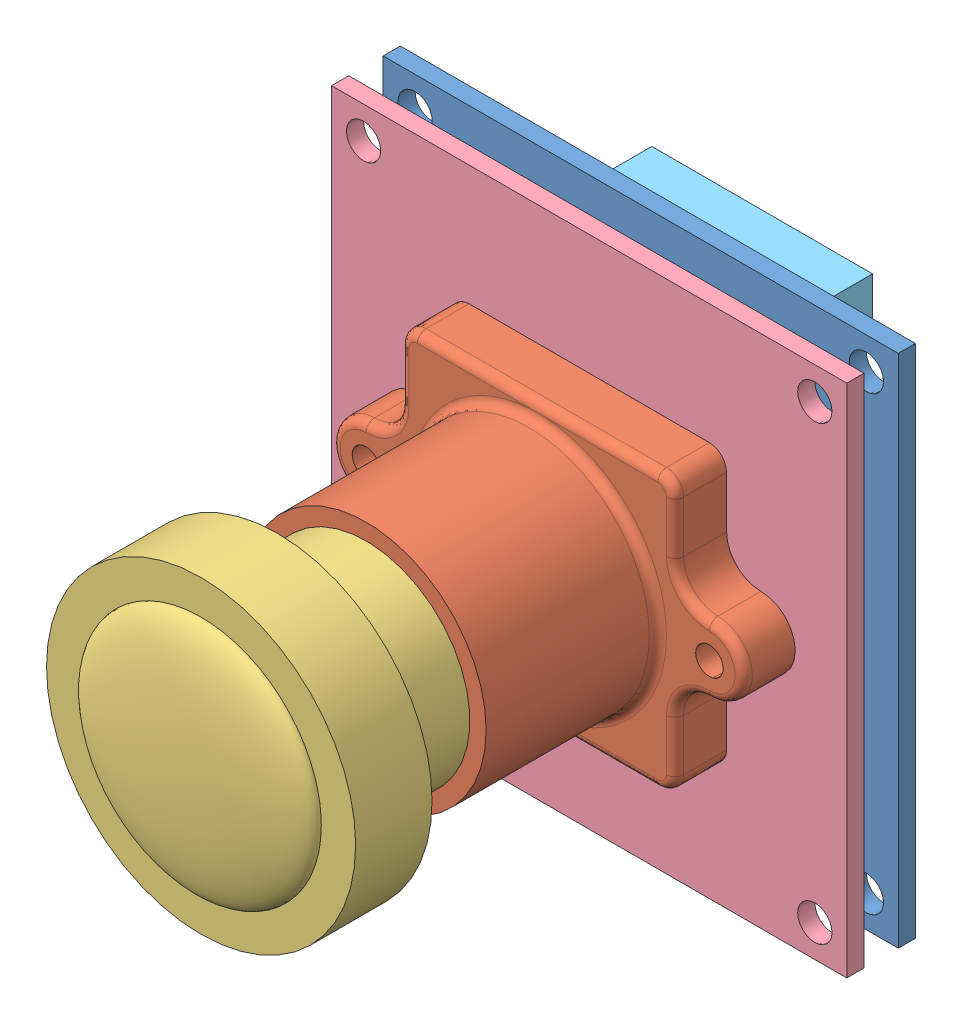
SolidWorks assembly See3CAM_CU20.SLDASM, configuration Default (file format 10000). Lengths in mm.
Overall size (30 30 33).
5 component instances, 5 part files, 10 mates.
Components (placement in the parent):
- ee3CAM_CU20 base board-1: ee3CAM_CU20 base board.SLDPRT [Default] at (73.0654 11.6886 8.7544) size (30 30 3)
- Lens holder-1: Lens holder.SLDPRT [Default] at (73.0654 11.6886 12.7544) x (0 1 0) z (1 0 0) size (16 13 24)
- See3CAM_CU20 lens-1: See3CAM_CU20 lens.SLDPRT [Default] at (73.0654 11.6886 35.3544) x (0 0 -1) z (1 0 0) size (19.2 18 18)
- See3CAM_CU20 module board-1: See3CAM_CU20 module board.SLDPRT [Default] at (73.0654 11.6886 11.7544) size (30 30 1)
- USB 3.1 Micro B-1: USB 3.1 Micro B.SLDPRT [Default] at (74.1387 22.4483 6.2544) x (-1 0 0) z (0 0 -1) size (12.85 3 5)
Mates (geometry in assembly coordinates):
- Coincident1: coincident anti-aligned: plane of ee3CAM_CU20 base board-1 through (73.0654 11.6886 11.7544) normal (0 0 1); plane of See3CAM_CU20 module board-1 through (73.0654 11.6886 11.7544) normal (0 0 -1)
- Concentric1: concentric aligned: cylinder of ee3CAM_CU20 base board-1 through (86.2054 24.8286 8.7544) axis (0 0 1) radius 1; cylinder of See3CAM_CU20 module board-1 through (86.2054 24.8286 11.7544) axis (0 0 1) radius 1
- Concentric2: concentric aligned: cylinder of ee3CAM_CU20 base board-1 through (59.9254 24.8286 8.7544) axis (0 0 1) radius 1; cylinder of See3CAM_CU20 module board-1 through (59.9254 24.8286 11.7544) axis (0 0 1) radius 1
- Concentric3: concentric aligned: cylinder of Lens holder-1 through (83.0654 11.6886 12.7544) axis (0 0 1) radius 0.8; cylinder of See3CAM_CU20 module board-1 through (83.0654 11.6886 11.7544) axis (0 0 1) radius 1.125
- Concentric4: concentric aligned: cylinder of Lens holder-1 through (63.0654 11.6886 12.7544) axis (0 0 1) radius 0.8; cylinder of See3CAM_CU20 module board-1 through (63.0654 11.6886 11.7544) axis (0 0 1) radius 1.125
- Coincident3: coincident anti-aligned: plane of Lens holder-1 through (63.0654 11.6886 12.7544) normal (0 0 -1); plane of See3CAM_CU20 module board-1 through (73.0654 11.6886 12.7544) normal (0 0 1)
- Concentric5: concentric anti-aligned: cylinder of Lens holder-1 through (73.0654 11.6886 25.7544) axis (0 0 1) radius 5.4; cylinder of See3CAM_CU20 lens-1 through (73.0654 11.6886 17.5544) axis (0 0 -1) radius 5.5
- Coincident4: coincident anti-aligned: plane of Lens holder-1 through (73.0654 11.6886 25.7544) normal (0 0 1); plane of See3CAM_CU20 lens-1 through (73.0654 17.7386 25.7544) normal (0 0 -1)
- Coincident5: coincident anti-aligned: plane of ee3CAM_CU20 base board-1 through (73.0654 11.6886 8.7544) normal (0 0 -1); plane of USB 3.1 Micro B-1 through (80.5637 23.9483 8.7544) normal (0 0 1)
- Parallel1: parallel anti-aligned: plane of ee3CAM_CU20 base board-1 through (58.0654 26.6886 9.7544) normal (0 1 0); plane of USB 3.1 Micro B-1 through (74.1387 20.9483 6.2544) normal (0 -1 0)
